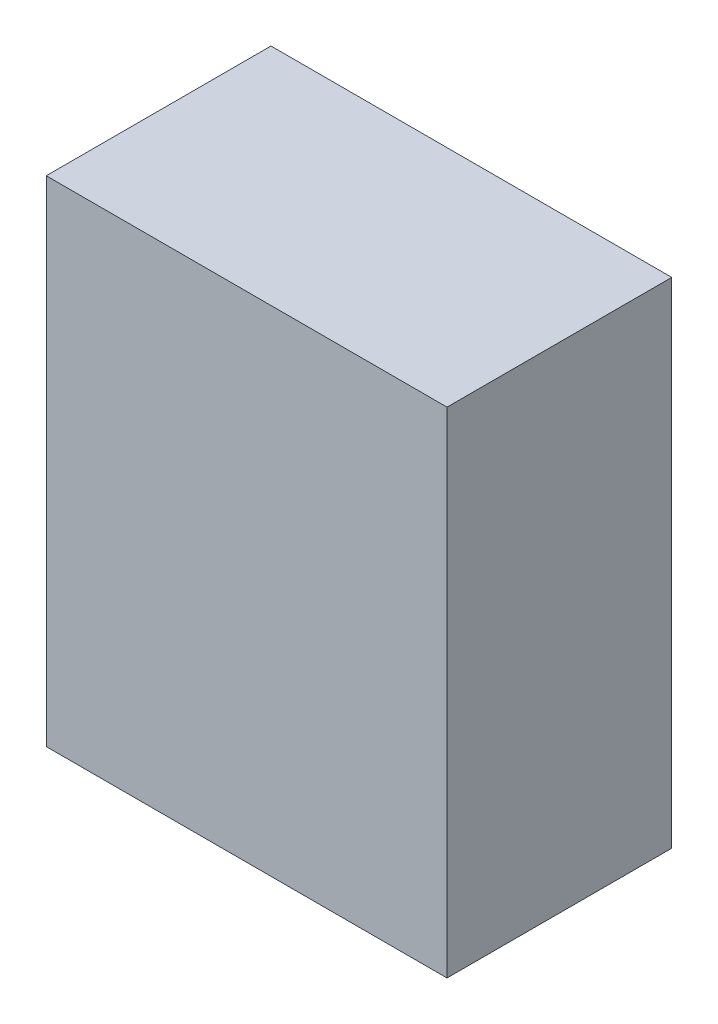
from build123d import *

# Parameters (mm, degrees)
GENERAL_W           = 1.069999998
GENERAL_H           = 1.320000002
BOSS_EXTRUDE1_DEPTH = 0.599999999


with BuildPart() as part:
    # GENERAL → Boss-Extrude1 (new body)
    with BuildSketch(Plane.XY):
        Rectangle(GENERAL_W, GENERAL_H)
    extrude(amount=BOSS_EXTRUDE1_DEPTH)


solid = part.part
